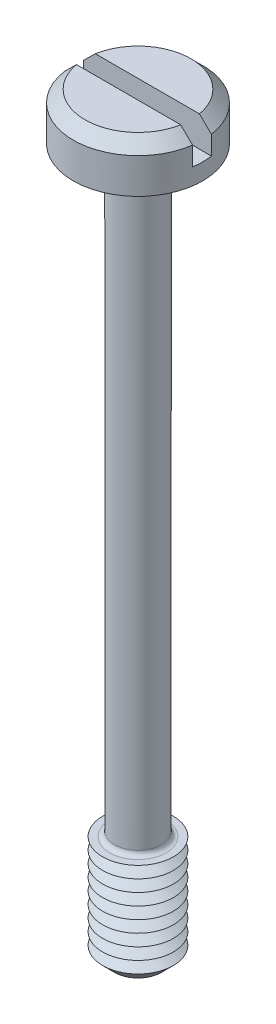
from build123d import *

# Parameters (mm, degrees)
SKETCH1_R           = 2.75
BOSS_EXTRUDE1_DEPTH = 2
SKETCH2_R           = 1
BOSS_EXTRUDE2_DEPTH = 30
SKETCH3_R           = 1.5
BOSS_EXTRUDE3_DEPTH = 4.5
CHAMFER1_SIZE       = 0.5
LPATTERN1_COUNT     = 8
LPATTERN1_PITCH     = 0.5
FILLET1_R           = 0.2
CHAMFER2_SIZE       = 0.5
SKETCH6_W           = 5.5
SKETCH6_H           = 0.8
CUT_EXTRUDE1_DEPTH  = 1.3


with BuildPart() as part:
    # Sketch1 → Boss-Extrude1 (new body)
    with BuildSketch(Plane(origin=(0, 0, 0), x_dir=(1, 0, 0), z_dir=(0, 1, 0))):
        with Locations(Location((0, 0, 0), (0, 0, 270))):
            Circle(SKETCH1_R)
    extrude(amount=BOSS_EXTRUDE1_DEPTH)

    # Sketch2 → Boss-Extrude2 (add)
    with BuildSketch(Plane.XZ):
        with Locations(Location((0, 0, 0), (0, 0, 270))):
            Circle(SKETCH2_R)
    extrude(amount=BOSS_EXTRUDE2_DEPTH)

    # Sketch3 → Boss-Extrude3 (add)
    with BuildSketch(Plane.XZ.offset(30)):
        with Locations(Location((0, 0, 0), (0, 0, 270))):
            Circle(SKETCH3_R)
    extrude(amount=-BOSS_EXTRUDE3_DEPTH)

    # Chamfer1
    chamfer1_edges = [part.edges().sort_by_distance(p)[0] for p in [
        (0, -30, 1.5),
    ]]
    chamfer(chamfer1_edges, length=CHAMFER1_SIZE)

    # Sketch5 → Cut-Revolve1 (revolve, cut)
    with BuildSketch(Plane(origin=(0, 0, 0), x_dir=(0, 0, -1), z_dir=(1, 0, 0))):
        Polygon((-1.5, -25.5), (-1.066987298, -25.75), (-1.5, -26), align=None)
    cut_revolve1 = revolve(axis=Axis((0, -6.58711856, 0), (0, -1, 0)), mode=Mode.SUBTRACT)

    # LPattern1: Cut-Revolve1 ×8
    with Locations(*[(0, -i * LPATTERN1_PITCH, 0) for i in range(1, LPATTERN1_COUNT)]):
        add(cut_revolve1, mode=Mode.SUBTRACT)

    # Fillet1
    fillet1_edges = [part.edges().sort_by_distance(p)[0] for p in [
        (0, 0, 1),
        (0, -25.5, 1),
    ]]
    fillet(fillet1_edges, radius=FILLET1_R)

    # Chamfer2
    chamfer2_edges = [part.edges().sort_by_distance(p)[0] for p in [
        (0, 2, -2.75),
    ]]
    chamfer(chamfer2_edges, length=CHAMFER2_SIZE)

    # Sketch6 → Cut-Extrude1 (cut)
    with BuildSketch(Plane(origin=(0, 2, 0), x_dir=(1, 0, 0), z_dir=(0, 1, 0))):
        Rectangle(SKETCH6_W, SKETCH6_H)
    extrude(amount=-CUT_EXTRUDE1_DEPTH, mode=Mode.SUBTRACT)


solid = part.part
